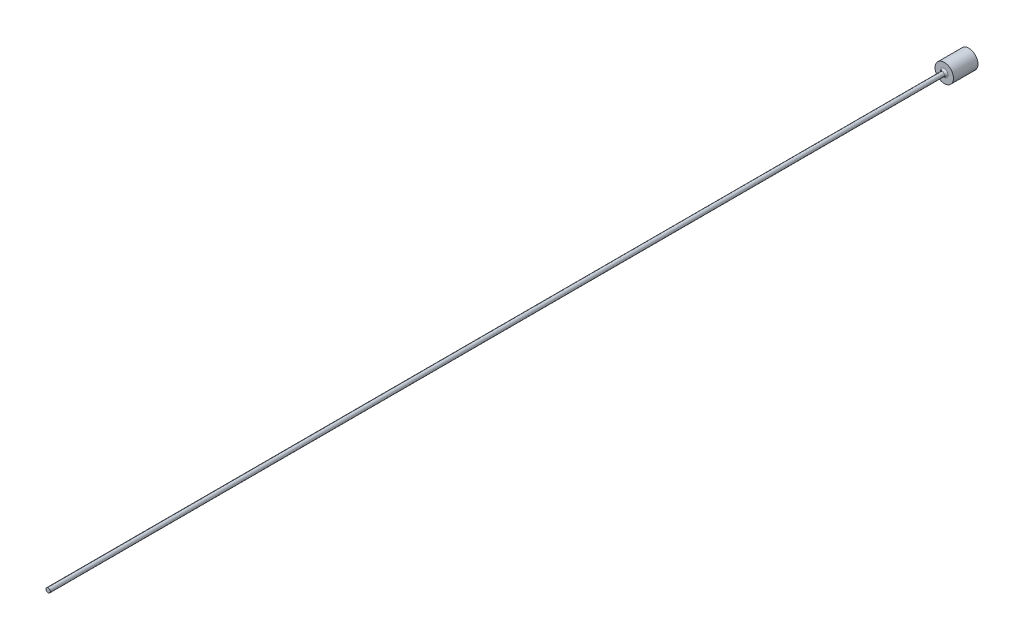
ISO-10303-21;
HEADER;
FILE_DESCRIPTION(('STEP AP214'),'2;1');
FILE_NAME('part.step','',(''),(''),'','','');
FILE_SCHEMA(('AUTOMOTIVE_DESIGN { 1 0 10303 214 1 1 1 1 }'));
ENDSEC;
DATA;
#1=APPLICATION_CONTEXT('core data for automotive mechanical design processes');
#2=APPLICATION_PROTOCOL_DEFINITION('international standard','automotive_design',2000,#1);
#3=PRODUCT_CONTEXT('',#1,'mechanical');
#4=PRODUCT('Part','Part','',(#3));
#5=PRODUCT_RELATED_PRODUCT_CATEGORY('part','',(#4));
#6=PRODUCT_DEFINITION_FORMATION('','',#4);
#7=PRODUCT_DEFINITION_CONTEXT('part definition',#1,'design');
#8=PRODUCT_DEFINITION('design','',#6,#7);
#9=PRODUCT_DEFINITION_SHAPE('','',#8);
#10=(LENGTH_UNIT() NAMED_UNIT(*) SI_UNIT(.MILLI.,.METRE.));
#11=(NAMED_UNIT(*) PLANE_ANGLE_UNIT() SI_UNIT($,.RADIAN.));
#12=(NAMED_UNIT(*) SI_UNIT($,.STERADIAN.) SOLID_ANGLE_UNIT());
#13=UNCERTAINTY_MEASURE_WITH_UNIT(LENGTH_MEASURE(1.E-05),#10,'distance_accuracy_value','');
#14=(GEOMETRIC_REPRESENTATION_CONTEXT(3) GLOBAL_UNCERTAINTY_ASSIGNED_CONTEXT((#13)) GLOBAL_UNIT_ASSIGNED_CONTEXT((#10,
#11,#12)) REPRESENTATION_CONTEXT('',''));
#15=CARTESIAN_POINT('',(0.,0.,0.));
#16=DIRECTION('',(0.,0.,1.));
#17=DIRECTION('',(1.,0.,0.));
#18=AXIS2_PLACEMENT_3D('',#15,#16,#17);
#19=CARTESIAN_POINT('',(1.5,0.,4.));
#20=DIRECTION('',(0.,0.,-1.));
#21=DIRECTION('',(-1.,0.,0.));
#22=AXIS2_PLACEMENT_3D('',#19,#20,#21);
#23=PLANE('',#22);
#24=CARTESIAN_POINT('',(0.,0.,4.));
#25=DIRECTION('',(0.,0.,-1.));
#26=DIRECTION('',(-1.,0.,0.));
#27=AXIS2_PLACEMENT_3D('',#24,#25,#26);
#28=CIRCLE('',#27,0.65000000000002);
#29=CARTESIAN_POINT('',(-0.650000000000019,0.,4.));
#30=VERTEX_POINT('',#29);
#31=EDGE_CURVE('E38',#30,#30,#28,.T.);
#32=ORIENTED_EDGE('',*,*,#31,.T.);
#33=EDGE_LOOP('',(#32));
#34=FACE_BOUND('',#33,.T.);
#35=CARTESIAN_POINT('',(0.,0.,4.));
#36=DIRECTION('',(0.,0.,-1.));
#37=DIRECTION('',(-1.,0.,0.));
#38=AXIS2_PLACEMENT_3D('',#35,#36,#37);
#39=CIRCLE('',#38,1.5);
#40=CARTESIAN_POINT('',(-1.5,0.,4.));
#41=VERTEX_POINT('',#40);
#42=EDGE_CURVE('E42',#41,#41,#39,.T.);
#43=ORIENTED_EDGE('',*,*,#42,.F.);
#44=EDGE_LOOP('',(#43));
#45=FACE_BOUND('',#44,.T.);
#46=ADVANCED_FACE('F31',(#34,#45),#23,.F.);
#47=CARTESIAN_POINT('',(0.,0.,-9.03322817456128));
#48=DIRECTION('',(0.,0.,-1.));
#49=DIRECTION('',(-1.,0.,0.));
#50=AXIS2_PLACEMENT_3D('',#47,#48,#49);
#51=CYLINDRICAL_SURFACE('',#50,1.5);
#52=CARTESIAN_POINT('',(0.,0.,0.));
#53=DIRECTION('',(0.,0.,-1.));
#54=DIRECTION('',(-1.,0.,0.));
#55=AXIS2_PLACEMENT_3D('',#52,#53,#54);
#56=CIRCLE('',#55,1.5);
#57=CARTESIAN_POINT('',(-1.5,0.,0.));
#58=VERTEX_POINT('',#57);
#59=EDGE_CURVE('E46',#58,#58,#56,.T.);
#60=ORIENTED_EDGE('',*,*,#59,.F.);
#61=EDGE_LOOP('',(#60));
#62=FACE_BOUND('',#61,.T.);
#63=ORIENTED_EDGE('',*,*,#42,.T.);
#64=EDGE_LOOP('',(#63));
#65=FACE_BOUND('',#64,.T.);
#66=ADVANCED_FACE('F66',(#62,#65),#51,.T.);
#67=CARTESIAN_POINT('',(0.,0.,0.));
#68=DIRECTION('',(0.,0.,1.));
#69=DIRECTION('',(1.,0.,0.));
#70=AXIS2_PLACEMENT_3D('',#67,#68,#69);
#71=PLANE('',#70);
#72=ORIENTED_EDGE('',*,*,#59,.T.);
#73=EDGE_LOOP('',(#72));
#74=FACE_BOUND('',#73,.T.);
#75=ADVANCED_FACE('F59',(#74),#71,.F.);
#76=CARTESIAN_POINT('',(0.,0.,150.));
#77=DIRECTION('',(0.,0.,-1.));
#78=DIRECTION('',(-1.,0.,0.));
#79=AXIS2_PLACEMENT_3D('',#76,#77,#78);
#80=PLANE('',#79);
#81=CARTESIAN_POINT('',(0.,0.,150.));
#82=DIRECTION('',(0.,0.,-1.));
#83=DIRECTION('',(-1.,0.,0.));
#84=AXIS2_PLACEMENT_3D('',#81,#82,#83);
#85=CIRCLE('',#84,0.35000000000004);
#86=CARTESIAN_POINT('',(-0.350000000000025,0.,150.));
#87=VERTEX_POINT('',#86);
#88=EDGE_CURVE('E51',#87,#87,#85,.T.);
#89=ORIENTED_EDGE('',*,*,#88,.F.);
#90=EDGE_LOOP('',(#89));
#91=FACE_BOUND('',#90,.T.);
#92=ADVANCED_FACE('F57',(#91),#80,.F.);
#93=CARTESIAN_POINT('',(0.,0.,-9.03322817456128));
#94=DIRECTION('',(0.,0.,-1.));
#95=DIRECTION('',(-1.,0.,0.));
#96=AXIS2_PLACEMENT_3D('',#93,#94,#95);
#97=CYLINDRICAL_SURFACE('',#96,0.35000000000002);
#98=CARTESIAN_POINT('',(0.,0.,4.3));
#99=DIRECTION('',(0.,0.,-1.));
#100=DIRECTION('',(-1.,0.,0.));
#101=AXIS2_PLACEMENT_3D('',#98,#99,#100);
#102=CIRCLE('',#101,0.35000000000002);
#103=CARTESIAN_POINT('',(-0.350000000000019,0.,4.3));
#104=VERTEX_POINT('',#103);
#105=EDGE_CURVE('E10',#104,#104,#102,.F.);
#106=ORIENTED_EDGE('',*,*,#105,.T.);
#107=EDGE_LOOP('',(#106));
#108=FACE_BOUND('',#107,.T.);
#109=ORIENTED_EDGE('',*,*,#88,.T.);
#110=EDGE_LOOP('',(#109));
#111=FACE_BOUND('',#110,.T.);
#112=ADVANCED_FACE('F55',(#108,#111),#97,.T.);
#113=CARTESIAN_POINT('',(0.,0.,4.3));
#114=DIRECTION('',(0.,0.,-1.));
#115=DIRECTION('',(-1.,0.,0.));
#116=AXIS2_PLACEMENT_3D('',#113,#114,#115);
#117=TOROIDAL_SURFACE('',#116,0.65000000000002,0.3);
#118=ORIENTED_EDGE('',*,*,#105,.F.);
#119=EDGE_LOOP('',(#118));
#120=FACE_BOUND('',#119,.T.);
#121=ORIENTED_EDGE('',*,*,#31,.F.);
#122=EDGE_LOOP('',(#121));
#123=FACE_BOUND('',#122,.T.);
#124=ADVANCED_FACE('F33',(#120,#123),#117,.F.);
#125=CLOSED_SHELL('',(#46,#66,#75,#92,#112,#124));
#126=MANIFOLD_SOLID_BREP('B2',#125);
#127=ADVANCED_BREP_SHAPE_REPRESENTATION('',(#18,#126),#14);
#128=SHAPE_DEFINITION_REPRESENTATION(#9,#127);
ENDSEC;
END-ISO-10303-21;
